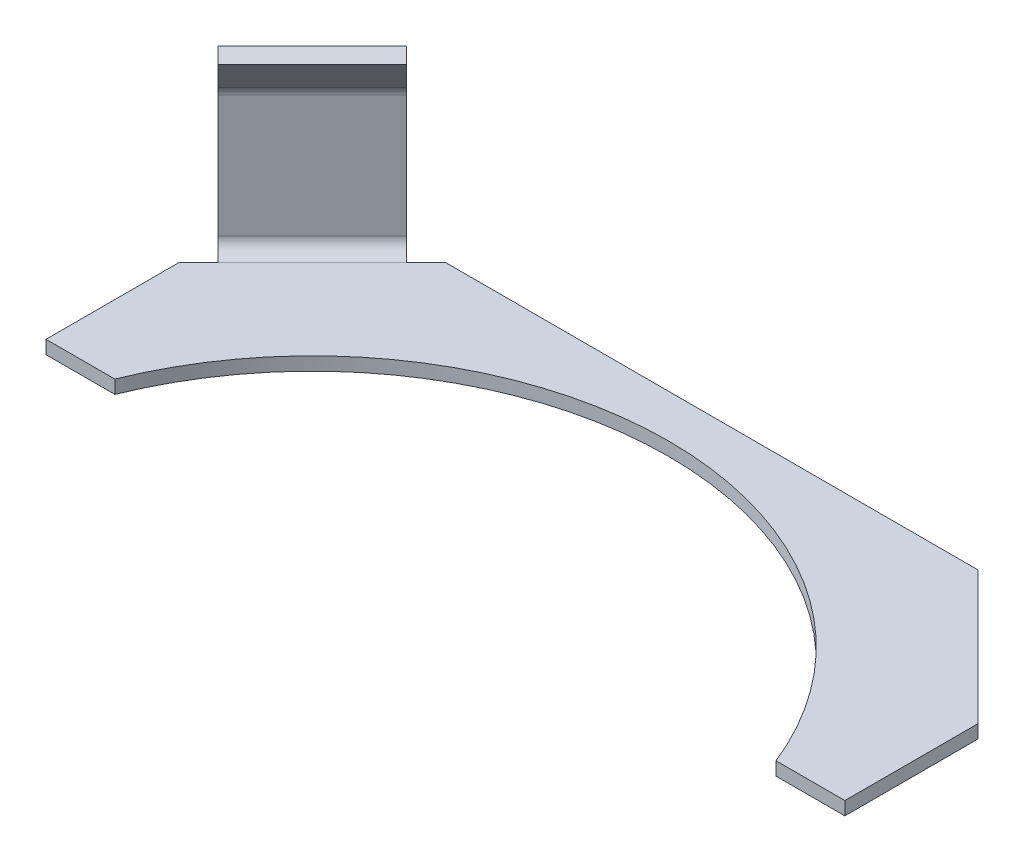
ISO-10303-21;
HEADER;
FILE_DESCRIPTION(('STEP AP214'),'2;1');
FILE_NAME('part.step','',(''),(''),'','','');
FILE_SCHEMA(('AUTOMOTIVE_DESIGN { 1 0 10303 214 1 1 1 1 }'));
ENDSEC;
DATA;
#1=APPLICATION_CONTEXT('core data for automotive mechanical design processes');
#2=APPLICATION_PROTOCOL_DEFINITION('international standard','automotive_design',2000,#1);
#3=PRODUCT_CONTEXT('',#1,'mechanical');
#4=PRODUCT('Part','Part','',(#3));
#5=PRODUCT_RELATED_PRODUCT_CATEGORY('part','',(#4));
#6=PRODUCT_DEFINITION_FORMATION('','',#4);
#7=PRODUCT_DEFINITION_CONTEXT('part definition',#1,'design');
#8=PRODUCT_DEFINITION('design','',#6,#7);
#9=PRODUCT_DEFINITION_SHAPE('','',#8);
#10=(LENGTH_UNIT() NAMED_UNIT(*) SI_UNIT(.MILLI.,.METRE.));
#11=(NAMED_UNIT(*) PLANE_ANGLE_UNIT() SI_UNIT($,.RADIAN.));
#12=(NAMED_UNIT(*) SI_UNIT($,.STERADIAN.) SOLID_ANGLE_UNIT());
#13=UNCERTAINTY_MEASURE_WITH_UNIT(LENGTH_MEASURE(1.E-05),#10,'distance_accuracy_value','');
#14=(GEOMETRIC_REPRESENTATION_CONTEXT(3) GLOBAL_UNCERTAINTY_ASSIGNED_CONTEXT((#13)) GLOBAL_UNIT_ASSIGNED_CONTEXT((#10,
#11,#12)) REPRESENTATION_CONTEXT('',''));
#15=CARTESIAN_POINT('',(0.,0.,0.));
#16=DIRECTION('',(0.,0.,1.));
#17=DIRECTION('',(1.,0.,0.));
#18=AXIS2_PLACEMENT_3D('',#15,#16,#17);
#19=CARTESIAN_POINT('',(-0.120425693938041,-0.733452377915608,-0.828102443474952));
#20=DIRECTION('',(-0.499999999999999,-0.707106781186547,-0.500000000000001));
#21=DIRECTION('',(0.707106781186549,0.,-0.707106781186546));
#22=AXIS2_PLACEMENT_3D('',#19,#20,#21);
#23=PLANE('',#22);
#24=DIRECTION('',(-0.499999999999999,0.707106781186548,-0.500000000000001));
#25=VECTOR('',#24,1.);
#26=CARTESIAN_POINT('',(-0.120425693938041,-0.733452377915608,-0.828102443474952));
#27=LINE('',#26,#25);
#28=CARTESIAN_POINT('',(-1.83758298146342,1.69497474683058,-2.54525973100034));
#29=VERTEX_POINT('',#28);
#30=CARTESIAN_POINT('',(-1.88758298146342,1.76568542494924,-2.59525973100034));
#31=VERTEX_POINT('',#30);
#32=EDGE_CURVE('E203',#29,#31,#27,.T.);
#33=ORIENTED_EDGE('',*,*,#32,.T.);
#34=DIRECTION('',(-0.707106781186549,0.,0.707106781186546));
#35=VECTOR('',#34,1.);
#36=CARTESIAN_POINT('',(-1.88758298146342,1.76568542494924,-2.59525973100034));
#37=LINE('',#36,#35);
#38=CARTESIAN_POINT('',(-2.59468976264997,1.76568542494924,-1.88815294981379));
#39=VERTEX_POINT('',#38);
#40=EDGE_CURVE('E194',#31,#39,#37,.T.);
#41=ORIENTED_EDGE('',*,*,#40,.T.);
#42=DIRECTION('',(-0.499999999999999,0.707106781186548,-0.500000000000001));
#43=VECTOR('',#42,1.);
#44=CARTESIAN_POINT('',(-0.82753247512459,-0.733452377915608,-0.120995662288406));
#45=LINE('',#44,#43);
#46=CARTESIAN_POINT('',(-2.54468976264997,1.69497474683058,-1.83815294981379));
#47=VERTEX_POINT('',#46);
#48=EDGE_CURVE('E223',#47,#39,#45,.T.);
#49=ORIENTED_EDGE('',*,*,#48,.F.);
#50=DIRECTION('',(-0.707106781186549,0.,0.707106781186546));
#51=VECTOR('',#50,1.);
#52=CARTESIAN_POINT('',(-1.83758298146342,1.69497474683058,-2.54525973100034));
#53=LINE('',#52,#51);
#54=EDGE_CURVE('E11',#29,#47,#53,.T.);
#55=ORIENTED_EDGE('',*,*,#54,.F.);
#56=EDGE_LOOP('',(#33,#41,#49,#55));
#57=FACE_BOUND('',#56,.T.);
#58=ADVANCED_FACE('F38',(#57),#23,.F.);
#59=CARTESIAN_POINT('',(-0.52042569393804,-1.29913780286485,-1.22810244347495));
#60=DIRECTION('',(-0.707106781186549,0.,0.707106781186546));
#61=DIRECTION('',(-0.499999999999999,-0.707106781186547,-0.500000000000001));
#62=AXIS2_PLACEMENT_3D('',#59,#60,#61);
#63=PLANE('',#62);
#64=DIRECTION('',(-0.499999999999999,0.707106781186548,-0.500000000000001));
#65=VECTOR('',#64,1.);
#66=CARTESIAN_POINT('',(-0.47900433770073,-1.24055915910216,-1.18668108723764));
#67=LINE('',#66,#65);
#68=CARTESIAN_POINT('',(-2.19616162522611,1.18786796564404,-2.90383837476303));
#69=VERTEX_POINT('',#68);
#70=CARTESIAN_POINT('',(-2.24616162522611,1.25857864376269,-2.95383837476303));
#71=VERTEX_POINT('',#70);
#72=EDGE_CURVE('E186',#69,#71,#67,.T.);
#73=ORIENTED_EDGE('',*,*,#72,.T.);
#74=DIRECTION('',(0.499999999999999,0.707106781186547,0.500000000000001));
#75=VECTOR('',#74,1.);
#76=CARTESIAN_POINT('',(-2.28758298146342,1.2,-2.99525973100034));
#77=LINE('',#76,#75);
#78=EDGE_CURVE('E70',#71,#31,#77,.T.);
#79=ORIENTED_EDGE('',*,*,#78,.T.);
#80=ORIENTED_EDGE('',*,*,#32,.F.);
#81=DIRECTION('',(0.499999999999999,0.707106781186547,0.500000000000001));
#82=VECTOR('',#81,1.);
#83=CARTESIAN_POINT('',(-2.23758298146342,1.12928932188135,-2.94525973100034));
#84=LINE('',#83,#82);
#85=EDGE_CURVE('E48',#69,#29,#84,.T.);
#86=ORIENTED_EDGE('',*,*,#85,.F.);
#87=EDGE_LOOP('',(#73,#79,#80,#86));
#88=FACE_BOUND('',#87,.T.);
#89=ADVANCED_FACE('F193',(#88),#63,.F.);
#90=CARTESIAN_POINT('',(-2.28758298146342,1.2,-2.99525973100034));
#91=DIRECTION('',(0.499999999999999,-0.707106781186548,0.500000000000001));
#92=DIRECTION('',(0.,-0.577350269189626,-0.816496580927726));
#93=AXIS2_PLACEMENT_3D('',#90,#91,#92);
#94=PLANE('',#93);
#95=ORIENTED_EDGE('',*,*,#78,.F.);
#96=DIRECTION('',(-0.707106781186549,0.,0.707106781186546));
#97=VECTOR('',#96,1.);
#98=CARTESIAN_POINT('',(-2.24616162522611,1.25857864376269,-2.95383837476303));
#99=LINE('',#98,#97);
#100=CARTESIAN_POINT('',(-2.95326840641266,1.25857864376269,-2.24673159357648));
#101=VERTEX_POINT('',#100);
#102=EDGE_CURVE('E175',#71,#101,#99,.T.);
#103=ORIENTED_EDGE('',*,*,#102,.T.);
#104=DIRECTION('',(0.499999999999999,0.707106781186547,0.500000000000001));
#105=VECTOR('',#104,1.);
#106=CARTESIAN_POINT('',(-2.99468976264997,1.2,-2.28815294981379));
#107=LINE('',#106,#105);
#108=EDGE_CURVE('E182',#101,#39,#107,.T.);
#109=ORIENTED_EDGE('',*,*,#108,.T.);
#110=ORIENTED_EDGE('',*,*,#40,.F.);
#111=EDGE_LOOP('',(#95,#103,#109,#110));
#112=FACE_BOUND('',#111,.T.);
#113=ADVANCED_FACE('F197',(#112),#94,.F.);
#114=CARTESIAN_POINT('',(-1.22753247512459,-1.29913780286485,-0.520995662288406));
#115=DIRECTION('',(-0.707106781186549,0.,0.707106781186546));
#116=DIRECTION('',(-0.499999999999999,-0.707106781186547,-0.500000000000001));
#117=AXIS2_PLACEMENT_3D('',#114,#115,#116);
#118=PLANE('',#117);
#119=ORIENTED_EDGE('',*,*,#108,.F.);
#120=DIRECTION('',(-0.499999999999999,0.707106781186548,-0.500000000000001));
#121=VECTOR('',#120,1.);
#122=CARTESIAN_POINT('',(-1.18611111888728,-1.24055915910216,-0.479574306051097));
#123=LINE('',#122,#121);
#124=CARTESIAN_POINT('',(-2.90326840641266,1.18786796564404,-2.19673159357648));
#125=VERTEX_POINT('',#124);
#126=EDGE_CURVE('E204',#125,#101,#123,.T.);
#127=ORIENTED_EDGE('',*,*,#126,.F.);
#128=DIRECTION('',(0.499999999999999,0.707106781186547,0.500000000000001));
#129=VECTOR('',#128,1.);
#130=CARTESIAN_POINT('',(-2.94468976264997,1.12928932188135,-2.23815294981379));
#131=LINE('',#130,#129);
#132=EDGE_CURVE('E225',#125,#47,#131,.T.);
#133=ORIENTED_EDGE('',*,*,#132,.T.);
#134=ORIENTED_EDGE('',*,*,#48,.T.);
#135=EDGE_LOOP('',(#119,#127,#133,#134));
#136=FACE_BOUND('',#135,.T.);
#137=ADVANCED_FACE('F227',(#136),#118,.T.);
#138=CARTESIAN_POINT('',(-2.23758298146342,1.12928932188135,-2.94525973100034));
#139=DIRECTION('',(0.499999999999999,-0.707106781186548,0.500000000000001));
#140=DIRECTION('',(0.,-0.577350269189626,-0.816496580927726));
#141=AXIS2_PLACEMENT_3D('',#138,#139,#140);
#142=PLANE('',#141);
#143=DIRECTION('',(-0.707106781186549,0.,0.707106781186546));
#144=VECTOR('',#143,1.);
#145=CARTESIAN_POINT('',(-2.19616162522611,1.18786796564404,-2.90383837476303));
#146=LINE('',#145,#144);
#147=EDGE_CURVE('E42',#69,#125,#146,.T.);
#148=ORIENTED_EDGE('',*,*,#147,.F.);
#149=ORIENTED_EDGE('',*,*,#85,.T.);
#150=ORIENTED_EDGE('',*,*,#54,.T.);
#151=ORIENTED_EDGE('',*,*,#132,.F.);
#152=EDGE_LOOP('',(#148,#149,#150,#151));
#153=FACE_BOUND('',#152,.T.);
#154=ADVANCED_FACE('F40',(#153),#142,.T.);
#155=CARTESIAN_POINT('',(0.494397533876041,0.1,-0.213279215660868));
#156=DIRECTION('',(-0.707106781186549,0.,0.707106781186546));
#157=DIRECTION('',(0.,-1.,0.));
#158=AXIS2_PLACEMENT_3D('',#155,#156,#157);
#159=PLANE('',#158);
#160=DIRECTION('',(-0.707106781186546,0.,-0.707106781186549));
#161=VECTOR('',#160,1.);
#162=CARTESIAN_POINT('',(0.494397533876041,0.2,-0.213279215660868));
#163=LINE('',#162,#161);
#164=CARTESIAN_POINT('',(-2.21687230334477,0.2,-2.92454905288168));
#165=VERTEX_POINT('',#164);
#166=CARTESIAN_POINT('',(-2.28758298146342,0.2,-2.99525973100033));
#167=VERTEX_POINT('',#166);
#168=EDGE_CURVE('E257',#165,#167,#163,.T.);
#169=ORIENTED_EDGE('',*,*,#168,.T.);
#170=DIRECTION('',(0.,-1.,0.));
#171=VECTOR('',#170,1.);
#172=CARTESIAN_POINT('',(-2.2875829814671,0.1,-2.99525973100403));
#173=LINE('',#172,#171);
#174=CARTESIAN_POINT('',(-2.28758298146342,1.11715728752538,-2.99525973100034));
#175=VERTEX_POINT('',#174);
#176=EDGE_CURVE('E258',#175,#167,#173,.T.);
#177=ORIENTED_EDGE('',*,*,#176,.F.);
#178=DIRECTION('',(-0.707106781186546,0.,-0.707106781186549));
#179=VECTOR('',#178,1.);
#180=CARTESIAN_POINT('',(0.494397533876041,1.11715728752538,-0.213279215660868));
#181=LINE('',#180,#179);
#182=CARTESIAN_POINT('',(-2.21687230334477,1.11715728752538,-2.92454905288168));
#183=VERTEX_POINT('',#182);
#184=EDGE_CURVE('E189',#183,#175,#181,.T.);
#185=ORIENTED_EDGE('',*,*,#184,.F.);
#186=DIRECTION('',(0.,1.,0.));
#187=VECTOR('',#186,1.);
#188=CARTESIAN_POINT('',(-2.21687230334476,0.1,-2.92454905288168));
#189=LINE('',#188,#187);
#190=EDGE_CURVE('E260',#165,#183,#189,.T.);
#191=ORIENTED_EDGE('',*,*,#190,.F.);
#192=EDGE_LOOP('',(#169,#177,#185,#191));
#193=FACE_BOUND('',#192,.T.);
#194=ADVANCED_FACE('F237',(#193),#159,.F.);
#195=CARTESIAN_POINT('',(-0.212709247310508,0.1,0.493827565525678));
#196=DIRECTION('',(-0.707106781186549,0.,0.707106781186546));
#197=DIRECTION('',(0.,-1.,0.));
#198=AXIS2_PLACEMENT_3D('',#195,#196,#197);
#199=PLANE('',#198);
#200=DIRECTION('',(0.,-1.,0.));
#201=VECTOR('',#200,1.);
#202=CARTESIAN_POINT('',(-2.9946897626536,0.1,-2.28815294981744));
#203=LINE('',#202,#201);
#204=CARTESIAN_POINT('',(-2.99468976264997,1.11715728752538,-2.28815294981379));
#205=VERTEX_POINT('',#204);
#206=CARTESIAN_POINT('',(-2.9946897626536,0.200000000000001,-2.28815294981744));
#207=VERTEX_POINT('',#206);
#208=EDGE_CURVE('E268',#205,#207,#203,.T.);
#209=ORIENTED_EDGE('',*,*,#208,.T.);
#210=DIRECTION('',(-0.707106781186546,0.,-0.707106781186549));
#211=VECTOR('',#210,1.);
#212=CARTESIAN_POINT('',(-0.212709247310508,0.200000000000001,0.493827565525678));
#213=LINE('',#212,#211);
#214=CARTESIAN_POINT('',(-2.92397908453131,0.2,-2.21744227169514));
#215=VERTEX_POINT('',#214);
#216=EDGE_CURVE('E264',#215,#207,#213,.T.);
#217=ORIENTED_EDGE('',*,*,#216,.F.);
#218=DIRECTION('',(0.,1.,0.));
#219=VECTOR('',#218,1.);
#220=CARTESIAN_POINT('',(-2.92397908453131,0.1,-2.21744227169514));
#221=LINE('',#220,#219);
#222=CARTESIAN_POINT('',(-2.92397908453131,1.11715728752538,-2.21744227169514));
#223=VERTEX_POINT('',#222);
#224=EDGE_CURVE('E270',#215,#223,#221,.T.);
#225=ORIENTED_EDGE('',*,*,#224,.T.);
#226=DIRECTION('',(-0.707106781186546,0.,-0.707106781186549));
#227=VECTOR('',#226,1.);
#228=CARTESIAN_POINT('',(-0.212709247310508,1.11715728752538,0.493827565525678));
#229=LINE('',#228,#227);
#230=EDGE_CURVE('E283',#223,#205,#229,.T.);
#231=ORIENTED_EDGE('',*,*,#230,.T.);
#232=EDGE_LOOP('',(#209,#217,#225,#231));
#233=FACE_BOUND('',#232,.T.);
#234=ADVANCED_FACE('F248',(#233),#199,.T.);
#235=CARTESIAN_POINT('',(-2.21687230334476,0.1,-2.92454905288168));
#236=DIRECTION('',(0.707106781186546,0.,0.707106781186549));
#237=DIRECTION('',(0.707106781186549,0.,-0.707106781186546));
#238=AXIS2_PLACEMENT_3D('',#235,#236,#237);
#239=PLANE('',#238);
#240=ORIENTED_EDGE('',*,*,#190,.T.);
#241=DIRECTION('',(-0.707106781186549,0.,0.707106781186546));
#242=VECTOR('',#241,1.);
#243=CARTESIAN_POINT('',(-2.21687230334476,1.11715728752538,-2.92454905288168));
#244=LINE('',#243,#242);
#245=EDGE_CURVE('E265',#183,#223,#244,.T.);
#246=ORIENTED_EDGE('',*,*,#245,.T.);
#247=ORIENTED_EDGE('',*,*,#224,.F.);
#248=DIRECTION('',(-0.707106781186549,0.,0.707106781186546));
#249=VECTOR('',#248,1.);
#250=CARTESIAN_POINT('',(-2.21687230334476,0.2,-2.92454905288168));
#251=LINE('',#250,#249);
#252=EDGE_CURVE('E214',#165,#215,#251,.T.);
#253=ORIENTED_EDGE('',*,*,#252,.F.);
#254=EDGE_LOOP('',(#240,#246,#247,#253));
#255=FACE_BOUND('',#254,.T.);
#256=ADVANCED_FACE('F253',(#255),#239,.T.);
#257=CARTESIAN_POINT('',(-2.9946897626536,0.1,-2.28815294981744));
#258=DIRECTION('',(0.707106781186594,0.,0.707106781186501));
#259=DIRECTION('',(0.707106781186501,0.,-0.707106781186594));
#260=AXIS2_PLACEMENT_3D('',#257,#258,#259);
#261=PLANE('',#260);
#262=DIRECTION('',(-0.707106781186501,0.,0.707106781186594));
#263=VECTOR('',#262,1.);
#264=CARTESIAN_POINT('',(-2.28758298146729,1.11715728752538,-2.99525973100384));
#265=LINE('',#264,#263);
#266=EDGE_CURVE('E90',#175,#205,#265,.T.);
#267=ORIENTED_EDGE('',*,*,#266,.F.);
#268=ORIENTED_EDGE('',*,*,#176,.T.);
#269=DIRECTION('',(-0.707106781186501,0.,0.707106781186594));
#270=VECTOR('',#269,1.);
#271=CARTESIAN_POINT('',(-2.28758298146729,0.200000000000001,-2.99525973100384));
#272=LINE('',#271,#270);
#273=EDGE_CURVE('E209',#167,#207,#272,.T.);
#274=ORIENTED_EDGE('',*,*,#273,.T.);
#275=ORIENTED_EDGE('',*,*,#208,.F.);
#276=EDGE_LOOP('',(#267,#268,#274,#275));
#277=FACE_BOUND('',#276,.T.);
#278=ADVANCED_FACE('F267',(#277),#261,.F.);
#279=CARTESIAN_POINT('',(2.00000000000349,12.7491106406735,-3.));
#280=DIRECTION('',(0.,0.,1.));
#281=DIRECTION('',(1.,0.,0.));
#282=AXIS2_PLACEMENT_3D('',#279,#280,#281);
#283=PLANE('',#282);
#284=DIRECTION('',(0.,-1.,0.));
#285=VECTOR('',#284,1.);
#286=CARTESIAN_POINT('',(2.00000000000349,12.7491106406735,-3.));
#287=LINE('',#286,#285);
#288=CARTESIAN_POINT('',(2.00000000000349,0.100000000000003,-3.));
#289=VERTEX_POINT('',#288);
#290=CARTESIAN_POINT('',(2.00000000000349,0.,-3.));
#291=VERTEX_POINT('',#290);
#292=EDGE_CURVE('E391',#289,#291,#287,.T.);
#293=ORIENTED_EDGE('',*,*,#292,.T.);
#294=DIRECTION('',(-1.,0.,0.));
#295=VECTOR('',#294,1.);
#296=CARTESIAN_POINT('',(2.00000000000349,0.,-3.));
#297=LINE('',#296,#295);
#298=CARTESIAN_POINT('',(-1.99999999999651,0.,-3.));
#299=VERTEX_POINT('',#298);
#300=EDGE_CURVE('E388',#291,#299,#297,.T.);
#301=ORIENTED_EDGE('',*,*,#300,.T.);
#302=DIRECTION('',(0.,-1.,0.));
#303=VECTOR('',#302,1.);
#304=CARTESIAN_POINT('',(-1.99999999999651,12.7491106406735,-3.));
#305=LINE('',#304,#303);
#306=CARTESIAN_POINT('',(-1.99999999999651,0.1,-3.));
#307=VERTEX_POINT('',#306);
#308=EDGE_CURVE('E315',#307,#299,#305,.T.);
#309=ORIENTED_EDGE('',*,*,#308,.F.);
#310=DIRECTION('',(-1.,0.,0.));
#311=VECTOR('',#310,1.);
#312=CARTESIAN_POINT('',(2.00000000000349,0.1,-3.));
#313=LINE('',#312,#311);
#314=EDGE_CURVE('E322',#289,#307,#313,.T.);
#315=ORIENTED_EDGE('',*,*,#314,.F.);
#316=EDGE_LOOP('',(#293,#301,#309,#315));
#317=FACE_BOUND('',#316,.T.);
#318=ADVANCED_FACE('F409',(#317),#283,.F.);
#319=CARTESIAN_POINT('',(3.00000000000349,12.7491106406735,-2.));
#320=DIRECTION('',(-0.707106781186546,0.,0.707106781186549));
#321=DIRECTION('',(0.707106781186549,0.,0.707106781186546));
#322=AXIS2_PLACEMENT_3D('',#319,#320,#321);
#323=PLANE('',#322);
#324=DIRECTION('',(0.,-1.,0.));
#325=VECTOR('',#324,1.);
#326=CARTESIAN_POINT('',(3.00000000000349,12.7491106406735,-2.));
#327=LINE('',#326,#325);
#328=CARTESIAN_POINT('',(3.00000000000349,0.100000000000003,-2.));
#329=VERTEX_POINT('',#328);
#330=CARTESIAN_POINT('',(3.00000000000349,0.,-2.));
#331=VERTEX_POINT('',#330);
#332=EDGE_CURVE('E385',#329,#331,#327,.T.);
#333=ORIENTED_EDGE('',*,*,#332,.T.);
#334=DIRECTION('',(-0.707106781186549,0.,-0.707106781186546));
#335=VECTOR('',#334,1.);
#336=CARTESIAN_POINT('',(3.00000000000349,0.,-2.));
#337=LINE('',#336,#335);
#338=EDGE_CURVE('E382',#331,#291,#337,.T.);
#339=ORIENTED_EDGE('',*,*,#338,.T.);
#340=ORIENTED_EDGE('',*,*,#292,.F.);
#341=DIRECTION('',(-0.707106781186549,0.,-0.707106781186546));
#342=VECTOR('',#341,1.);
#343=CARTESIAN_POINT('',(3.00000000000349,0.1,-2.));
#344=LINE('',#343,#342);
#345=EDGE_CURVE('E325',#329,#289,#344,.T.);
#346=ORIENTED_EDGE('',*,*,#345,.F.);
#347=EDGE_LOOP('',(#333,#339,#340,#346));
#348=FACE_BOUND('',#347,.T.);
#349=ADVANCED_FACE('F412',(#348),#323,.F.);
#350=CARTESIAN_POINT('',(3.00000000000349,12.7491106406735,-1.));
#351=DIRECTION('',(-1.,0.,0.));
#352=DIRECTION('',(0.,0.,1.));
#353=AXIS2_PLACEMENT_3D('',#350,#351,#352);
#354=PLANE('',#353);
#355=DIRECTION('',(0.,-1.,0.));
#356=VECTOR('',#355,1.);
#357=CARTESIAN_POINT('',(3.00000000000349,12.7491106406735,-1.));
#358=LINE('',#357,#356);
#359=CARTESIAN_POINT('',(3.00000000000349,0.100000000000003,-1.));
#360=VERTEX_POINT('',#359);
#361=CARTESIAN_POINT('',(3.00000000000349,0.,-1.));
#362=VERTEX_POINT('',#361);
#363=EDGE_CURVE('E379',#360,#362,#358,.T.);
#364=ORIENTED_EDGE('',*,*,#363,.T.);
#365=DIRECTION('',(0.,0.,-1.));
#366=VECTOR('',#365,1.);
#367=CARTESIAN_POINT('',(3.00000000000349,0.,-1.));
#368=LINE('',#367,#366);
#369=EDGE_CURVE('E376',#362,#331,#368,.T.);
#370=ORIENTED_EDGE('',*,*,#369,.T.);
#371=ORIENTED_EDGE('',*,*,#332,.F.);
#372=DIRECTION('',(0.,0.,-1.));
#373=VECTOR('',#372,1.);
#374=CARTESIAN_POINT('',(3.00000000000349,0.1,-1.));
#375=LINE('',#374,#373);
#376=EDGE_CURVE('E328',#360,#329,#375,.T.);
#377=ORIENTED_EDGE('',*,*,#376,.F.);
#378=EDGE_LOOP('',(#364,#370,#371,#377));
#379=FACE_BOUND('',#378,.T.);
#380=ADVANCED_FACE('F415',(#379),#354,.F.);
#381=CARTESIAN_POINT('',(2.48286636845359,12.7491106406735,-1.00000000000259));
#382=DIRECTION('',(5.0137158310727E-12,0.,-1.));
#383=DIRECTION('',(-1.,0.,-5.0137158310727E-12));
#384=AXIS2_PLACEMENT_3D('',#381,#382,#383);
#385=PLANE('',#384);
#386=DIRECTION('',(0.,-1.,0.));
#387=VECTOR('',#386,1.);
#388=CARTESIAN_POINT('',(2.48286636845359,12.7491106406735,-1.00000000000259));
#389=LINE('',#388,#387);
#390=CARTESIAN_POINT('',(2.48286636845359,0.100000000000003,-1.00000000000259));
#391=VERTEX_POINT('',#390);
#392=CARTESIAN_POINT('',(2.48286636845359,0.,-1.00000000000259));
#393=VERTEX_POINT('',#392);
#394=EDGE_CURVE('E373',#391,#393,#389,.T.);
#395=ORIENTED_EDGE('',*,*,#394,.T.);
#396=DIRECTION('',(1.,0.,5.0137158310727E-12));
#397=VECTOR('',#396,1.);
#398=CARTESIAN_POINT('',(2.48286636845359,0.,-1.00000000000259));
#399=LINE('',#398,#397);
#400=EDGE_CURVE('E370',#393,#362,#399,.T.);
#401=ORIENTED_EDGE('',*,*,#400,.T.);
#402=ORIENTED_EDGE('',*,*,#363,.F.);
#403=DIRECTION('',(1.,0.,5.0137158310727E-12));
#404=VECTOR('',#403,1.);
#405=CARTESIAN_POINT('',(2.48286636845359,0.1,-1.00000000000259));
#406=LINE('',#405,#404);
#407=EDGE_CURVE('E331',#391,#360,#406,.T.);
#408=ORIENTED_EDGE('',*,*,#407,.F.);
#409=EDGE_LOOP('',(#395,#401,#402,#408));
#410=FACE_BOUND('',#409,.T.);
#411=ADVANCED_FACE('F421',(#410),#385,.F.);
#412=CARTESIAN_POINT('',(0.,12.7491106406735,0.));
#413=DIRECTION('',(0.,-1.,0.));
#414=DIRECTION('',(0.,0.,-1.));
#415=AXIS2_PLACEMENT_3D('',#412,#413,#414);
#416=CYLINDRICAL_SURFACE('',#415,2.67668178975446);
#417=DIRECTION('',(0.,-1.,0.));
#418=VECTOR('',#417,1.);
#419=CARTESIAN_POINT('',(-2.48286636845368,12.7491106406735,-1.00000000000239));
#420=LINE('',#419,#418);
#421=CARTESIAN_POINT('',(-2.48286636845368,0.100000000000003,-1.00000000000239));
#422=VERTEX_POINT('',#421);
#423=CARTESIAN_POINT('',(-2.48286636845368,0.,-1.00000000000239));
#424=VERTEX_POINT('',#423);
#425=EDGE_CURVE('E367',#422,#424,#420,.T.);
#426=ORIENTED_EDGE('',*,*,#425,.T.);
#427=CARTESIAN_POINT('',(0.,0.,0.));
#428=DIRECTION('',(0.,-1.,0.));
#429=DIRECTION('',(0.,0.,1.));
#430=AXIS2_PLACEMENT_3D('',#427,#428,#429);
#431=CIRCLE('',#430,2.67668178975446);
#432=EDGE_CURVE('E364',#424,#393,#431,.T.);
#433=ORIENTED_EDGE('',*,*,#432,.T.);
#434=ORIENTED_EDGE('',*,*,#394,.F.);
#435=CARTESIAN_POINT('',(0.,0.1,0.));
#436=DIRECTION('',(0.,-1.,0.));
#437=DIRECTION('',(0.,0.,1.));
#438=AXIS2_PLACEMENT_3D('',#435,#436,#437);
#439=CIRCLE('',#438,2.67668178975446);
#440=EDGE_CURVE('E334',#422,#391,#439,.T.);
#441=ORIENTED_EDGE('',*,*,#440,.F.);
#442=EDGE_LOOP('',(#426,#433,#434,#441));
#443=FACE_BOUND('',#442,.T.);
#444=ADVANCED_FACE('F423',(#443),#416,.F.);
#445=CARTESIAN_POINT('',(-2.99999999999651,12.7491106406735,-1.));
#446=DIRECTION('',(-4.61704650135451E-12,0.,-1.));
#447=DIRECTION('',(-1.,0.,4.61704650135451E-12));
#448=AXIS2_PLACEMENT_3D('',#445,#446,#447);
#449=PLANE('',#448);
#450=DIRECTION('',(0.,-1.,0.));
#451=VECTOR('',#450,1.);
#452=CARTESIAN_POINT('',(-2.99999999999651,12.7491106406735,-1.));
#453=LINE('',#452,#451);
#454=CARTESIAN_POINT('',(-2.99999999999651,0.100000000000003,-1.));
#455=VERTEX_POINT('',#454);
#456=CARTESIAN_POINT('',(-2.99999999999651,0.,-1.));
#457=VERTEX_POINT('',#456);
#458=EDGE_CURVE('E361',#455,#457,#453,.T.);
#459=ORIENTED_EDGE('',*,*,#458,.T.);
#460=DIRECTION('',(1.,0.,-4.61704650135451E-12));
#461=VECTOR('',#460,1.);
#462=CARTESIAN_POINT('',(-2.99999999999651,0.,-1.));
#463=LINE('',#462,#461);
#464=EDGE_CURVE('E358',#457,#424,#463,.T.);
#465=ORIENTED_EDGE('',*,*,#464,.T.);
#466=ORIENTED_EDGE('',*,*,#425,.F.);
#467=DIRECTION('',(1.,0.,-4.61704650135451E-12));
#468=VECTOR('',#467,1.);
#469=CARTESIAN_POINT('',(-2.99999999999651,0.1,-1.));
#470=LINE('',#469,#468);
#471=EDGE_CURVE('E337',#455,#422,#470,.T.);
#472=ORIENTED_EDGE('',*,*,#471,.F.);
#473=EDGE_LOOP('',(#459,#465,#466,#472));
#474=FACE_BOUND('',#473,.T.);
#475=ADVANCED_FACE('F426',(#474),#449,.F.);
#476=CARTESIAN_POINT('',(-2.99999999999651,12.7491106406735,-2.00000000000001));
#477=DIRECTION('',(1.,0.,0.));
#478=DIRECTION('',(0.,0.,-1.));
#479=AXIS2_PLACEMENT_3D('',#476,#477,#478);
#480=PLANE('',#479);
#481=DIRECTION('',(0.,-1.,0.));
#482=VECTOR('',#481,1.);
#483=CARTESIAN_POINT('',(-2.99999999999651,12.7491106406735,-2.00000000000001));
#484=LINE('',#483,#482);
#485=CARTESIAN_POINT('',(-2.99999999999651,0.100000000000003,-2.00000000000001));
#486=VERTEX_POINT('',#485);
#487=CARTESIAN_POINT('',(-2.99999999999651,0.,-2.00000000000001));
#488=VERTEX_POINT('',#487);
#489=EDGE_CURVE('E355',#486,#488,#484,.T.);
#490=ORIENTED_EDGE('',*,*,#489,.T.);
#491=DIRECTION('',(0.,0.,1.));
#492=VECTOR('',#491,1.);
#493=CARTESIAN_POINT('',(-2.99999999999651,0.,-2.00000000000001));
#494=LINE('',#493,#492);
#495=EDGE_CURVE('E352',#488,#457,#494,.T.);
#496=ORIENTED_EDGE('',*,*,#495,.T.);
#497=ORIENTED_EDGE('',*,*,#458,.F.);
#498=DIRECTION('',(0.,0.,1.));
#499=VECTOR('',#498,1.);
#500=CARTESIAN_POINT('',(-2.99999999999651,0.1,-2.00000000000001));
#501=LINE('',#500,#499);
#502=EDGE_CURVE('E340',#486,#455,#501,.T.);
#503=ORIENTED_EDGE('',*,*,#502,.F.);
#504=EDGE_LOOP('',(#490,#496,#497,#503));
#505=FACE_BOUND('',#504,.T.);
#506=ADVANCED_FACE('F429',(#505),#480,.F.);
#507=CARTESIAN_POINT('',(0.,0.1,0.));
#508=DIRECTION('',(0.,1.,0.));
#509=DIRECTION('',(0.,0.,1.));
#510=AXIS2_PLACEMENT_3D('',#507,#508,#509);
#511=PLANE('',#510);
#512=DIRECTION('',(-0.707106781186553,0.,0.707106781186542));
#513=VECTOR('',#512,1.);
#514=CARTESIAN_POINT('',(-1.99999999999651,0.1,-3.));
#515=LINE('',#514,#513);
#516=CARTESIAN_POINT('',(-2.14616162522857,0.0999999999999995,-2.85383837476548));
#517=VERTEX_POINT('',#516);
#518=EDGE_CURVE('E349',#307,#517,#515,.T.);
#519=ORIENTED_EDGE('',*,*,#518,.T.);
#520=DIRECTION('',(-0.707106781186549,0.,0.707106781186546));
#521=VECTOR('',#520,1.);
#522=CARTESIAN_POINT('',(-2.1461616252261,0.0999999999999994,-2.85383837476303));
#523=LINE('',#522,#521);
#524=CARTESIAN_POINT('',(-2.85326840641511,0.0999999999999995,-2.14673159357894));
#525=VERTEX_POINT('',#524);
#526=EDGE_CURVE('E346',#517,#525,#523,.T.);
#527=ORIENTED_EDGE('',*,*,#526,.T.);
#528=DIRECTION('',(-0.70710678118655,0.,0.707106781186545));
#529=VECTOR('',#528,1.);
#530=CARTESIAN_POINT('',(-2.85326840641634,0.1,-2.14673159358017));
#531=LINE('',#530,#529);
#532=EDGE_CURVE('E343',#525,#486,#531,.T.);
#533=ORIENTED_EDGE('',*,*,#532,.T.);
#534=ORIENTED_EDGE('',*,*,#502,.T.);
#535=ORIENTED_EDGE('',*,*,#471,.T.);
#536=ORIENTED_EDGE('',*,*,#440,.T.);
#537=ORIENTED_EDGE('',*,*,#407,.T.);
#538=ORIENTED_EDGE('',*,*,#376,.T.);
#539=ORIENTED_EDGE('',*,*,#345,.T.);
#540=ORIENTED_EDGE('',*,*,#314,.T.);
#541=EDGE_LOOP('',(#519,#527,#533,#534,#535,#536,#537,#538,#539,#540));
#542=FACE_BOUND('',#541,.T.);
#543=ADVANCED_FACE('F418',(#542),#511,.T.);
#544=CARTESIAN_POINT('',(-2.85326840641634,12.7491106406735,-2.14673159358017));
#545=DIRECTION('',(0.707106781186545,0.,0.70710678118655));
#546=DIRECTION('',(0.70710678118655,0.,-0.707106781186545));
#547=AXIS2_PLACEMENT_3D('',#544,#545,#546);
#548=PLANE('',#547);
#549=DIRECTION('',(0.,-1.,0.));
#550=VECTOR('',#549,1.);
#551=CARTESIAN_POINT('',(-2.85326840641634,12.7491106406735,-2.14673159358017));
#552=LINE('',#551,#550);
#553=CARTESIAN_POINT('',(-2.85326840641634,0.,-2.14673159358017));
#554=VERTEX_POINT('',#553);
#555=EDGE_CURVE('E305',#525,#554,#552,.T.);
#556=ORIENTED_EDGE('',*,*,#555,.T.);
#557=DIRECTION('',(-0.70710678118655,0.,0.707106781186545));
#558=VECTOR('',#557,1.);
#559=CARTESIAN_POINT('',(-2.85326840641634,0.,-2.14673159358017));
#560=LINE('',#559,#558);
#561=EDGE_CURVE('E318',#554,#488,#560,.T.);
#562=ORIENTED_EDGE('',*,*,#561,.T.);
#563=ORIENTED_EDGE('',*,*,#489,.F.);
#564=ORIENTED_EDGE('',*,*,#532,.F.);
#565=EDGE_LOOP('',(#556,#562,#563,#564));
#566=FACE_BOUND('',#565,.T.);
#567=ADVANCED_FACE('F432',(#566),#548,.F.);
#568=CARTESIAN_POINT('',(0.,0.,0.));
#569=DIRECTION('',(0.,1.,0.));
#570=DIRECTION('',(0.,0.,1.));
#571=AXIS2_PLACEMENT_3D('',#568,#569,#570);
#572=PLANE('',#571);
#573=DIRECTION('',(-0.707106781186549,0.,0.707106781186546));
#574=VECTOR('',#573,1.);
#575=CARTESIAN_POINT('',(-2.1461616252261,0.,-2.85383837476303));
#576=LINE('',#575,#574);
#577=CARTESIAN_POINT('',(-2.14616162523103,0.,-2.85383837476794));
#578=VERTEX_POINT('',#577);
#579=EDGE_CURVE('E394',#578,#554,#576,.T.);
#580=ORIENTED_EDGE('',*,*,#579,.F.);
#581=DIRECTION('',(-0.707106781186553,0.,0.707106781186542));
#582=VECTOR('',#581,1.);
#583=CARTESIAN_POINT('',(-1.99999999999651,0.,-3.));
#584=LINE('',#583,#582);
#585=EDGE_CURVE('E273',#299,#578,#584,.T.);
#586=ORIENTED_EDGE('',*,*,#585,.F.);
#587=ORIENTED_EDGE('',*,*,#300,.F.);
#588=ORIENTED_EDGE('',*,*,#338,.F.);
#589=ORIENTED_EDGE('',*,*,#369,.F.);
#590=ORIENTED_EDGE('',*,*,#400,.F.);
#591=ORIENTED_EDGE('',*,*,#432,.F.);
#592=ORIENTED_EDGE('',*,*,#464,.F.);
#593=ORIENTED_EDGE('',*,*,#495,.F.);
#594=ORIENTED_EDGE('',*,*,#561,.F.);
#595=EDGE_LOOP('',(#580,#586,#587,#588,#589,#590,#591,#592,#593,#594));
#596=FACE_BOUND('',#595,.T.);
#597=ADVANCED_FACE('F406',(#596),#572,.F.);
#598=CARTESIAN_POINT('',(-1.99999999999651,12.7491106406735,-3.));
#599=DIRECTION('',(0.707106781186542,0.,0.707106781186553));
#600=DIRECTION('',(0.707106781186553,0.,-0.707106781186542));
#601=AXIS2_PLACEMENT_3D('',#598,#599,#600);
#602=PLANE('',#601);
#603=ORIENTED_EDGE('',*,*,#308,.T.);
#604=ORIENTED_EDGE('',*,*,#585,.T.);
#605=DIRECTION('',(0.,-1.,0.));
#606=VECTOR('',#605,1.);
#607=CARTESIAN_POINT('',(-2.14616162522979,12.7491106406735,-2.85383837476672));
#608=LINE('',#607,#606);
#609=EDGE_CURVE('E395',#517,#578,#608,.T.);
#610=ORIENTED_EDGE('',*,*,#609,.F.);
#611=ORIENTED_EDGE('',*,*,#518,.F.);
#612=EDGE_LOOP('',(#603,#604,#610,#611));
#613=FACE_BOUND('',#612,.T.);
#614=ADVANCED_FACE('F407',(#613),#602,.F.);
#615=CARTESIAN_POINT('',(-2.85326840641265,0.2,-2.14673159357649));
#616=DIRECTION('',(-0.707106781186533,0.,0.707106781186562));
#617=DIRECTION('',(0.707106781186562,0.,0.707106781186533));
#618=AXIS2_PLACEMENT_3D('',#615,#616,#617);
#619=PLANE('',#618);
#620=ORIENTED_EDGE('',*,*,#555,.F.);
#621=CARTESIAN_POINT('',(-2.85326840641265,0.2,-2.14673159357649));
#622=DIRECTION('',(-0.707106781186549,0.,0.707106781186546));
#623=DIRECTION('',(0.707106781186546,0.,0.707106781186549));
#624=AXIS2_PLACEMENT_3D('',#621,#622,#623);
#625=CIRCLE('',#624,0.1);
#626=EDGE_CURVE('E299',#525,#215,#625,.F.);
#627=ORIENTED_EDGE('',*,*,#626,.T.);
#628=ORIENTED_EDGE('',*,*,#216,.T.);
#629=CARTESIAN_POINT('',(-2.85326840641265,0.2,-2.14673159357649));
#630=DIRECTION('',(-0.707106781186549,0.,0.707106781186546));
#631=DIRECTION('',(0.707106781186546,0.,0.707106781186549));
#632=AXIS2_PLACEMENT_3D('',#629,#630,#631);
#633=CIRCLE('',#632,0.2);
#634=EDGE_CURVE('E85',#554,#207,#633,.F.);
#635=ORIENTED_EDGE('',*,*,#634,.F.);
#636=EDGE_LOOP('',(#620,#627,#628,#635));
#637=FACE_BOUND('',#636,.T.);
#638=ADVANCED_FACE('F303',(#637),#619,.T.);
#639=CARTESIAN_POINT('',(-2.14616162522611,0.2,-2.85383837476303));
#640=DIRECTION('',(0.707106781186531,0.,-0.707106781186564));
#641=DIRECTION('',(-0.707106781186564,0.,-0.707106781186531));
#642=AXIS2_PLACEMENT_3D('',#639,#640,#641);
#643=PLANE('',#642);
#644=ORIENTED_EDGE('',*,*,#168,.F.);
#645=CARTESIAN_POINT('',(-2.14616162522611,0.2,-2.85383837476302));
#646=DIRECTION('',(-0.707106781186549,0.,0.707106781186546));
#647=DIRECTION('',(0.707106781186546,0.,0.707106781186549));
#648=AXIS2_PLACEMENT_3D('',#645,#646,#647);
#649=CIRCLE('',#648,0.1);
#650=EDGE_CURVE('E301',#165,#517,#649,.T.);
#651=ORIENTED_EDGE('',*,*,#650,.T.);
#652=ORIENTED_EDGE('',*,*,#609,.T.);
#653=CARTESIAN_POINT('',(-2.14616162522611,0.2,-2.85383837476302));
#654=DIRECTION('',(-0.707106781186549,0.,0.707106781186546));
#655=DIRECTION('',(0.707106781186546,0.,0.707106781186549));
#656=AXIS2_PLACEMENT_3D('',#653,#654,#655);
#657=CIRCLE('',#656,0.2);
#658=EDGE_CURVE('E306',#167,#578,#657,.T.);
#659=ORIENTED_EDGE('',*,*,#658,.F.);
#660=EDGE_LOOP('',(#644,#651,#652,#659));
#661=FACE_BOUND('',#660,.T.);
#662=ADVANCED_FACE('F399',(#661),#643,.T.);
#663=CARTESIAN_POINT('',(3.48073787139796,0.2,-8.48073787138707));
#664=DIRECTION('',(-0.707106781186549,0.,0.707106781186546));
#665=DIRECTION('',(0.707106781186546,0.,0.707106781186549));
#666=AXIS2_PLACEMENT_3D('',#663,#664,#665);
#667=CYLINDRICAL_SURFACE('',#666,0.2);
#668=ORIENTED_EDGE('',*,*,#658,.T.);
#669=ORIENTED_EDGE('',*,*,#579,.T.);
#670=ORIENTED_EDGE('',*,*,#634,.T.);
#671=ORIENTED_EDGE('',*,*,#273,.F.);
#672=EDGE_LOOP('',(#668,#669,#670,#671));
#673=FACE_BOUND('',#672,.T.);
#674=ADVANCED_FACE('F403',(#673),#667,.T.);
#675=CARTESIAN_POINT('',(3.48073787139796,0.2,-8.48073787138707));
#676=DIRECTION('',(-0.707106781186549,0.,0.707106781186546));
#677=DIRECTION('',(0.707106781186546,0.,0.707106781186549));
#678=AXIS2_PLACEMENT_3D('',#675,#676,#677);
#679=CYLINDRICAL_SURFACE('',#678,0.1);
#680=ORIENTED_EDGE('',*,*,#650,.F.);
#681=ORIENTED_EDGE('',*,*,#252,.T.);
#682=ORIENTED_EDGE('',*,*,#626,.F.);
#683=ORIENTED_EDGE('',*,*,#526,.F.);
#684=EDGE_LOOP('',(#680,#681,#682,#683));
#685=FACE_BOUND('',#684,.T.);
#686=ADVANCED_FACE('F297',(#685),#679,.F.);
#687=CARTESIAN_POINT('',(-2.85326840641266,1.11715728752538,-2.14673159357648));
#688=DIRECTION('',(-0.707106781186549,0.,0.707106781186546));
#689=DIRECTION('',(0.707106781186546,0.,0.707106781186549));
#690=AXIS2_PLACEMENT_3D('',#687,#688,#689);
#691=PLANE('',#690);
#692=ORIENTED_EDGE('',*,*,#230,.F.);
#693=CARTESIAN_POINT('',(-2.85326840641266,1.11715728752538,-2.14673159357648));
#694=DIRECTION('',(-0.707106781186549,0.,0.707106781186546));
#695=DIRECTION('',(0.707106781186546,0.,0.707106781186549));
#696=AXIS2_PLACEMENT_3D('',#693,#694,#695);
#697=CIRCLE('',#696,0.1);
#698=EDGE_CURVE('E190',#223,#125,#697,.F.);
#699=ORIENTED_EDGE('',*,*,#698,.T.);
#700=ORIENTED_EDGE('',*,*,#126,.T.);
#701=CARTESIAN_POINT('',(-2.85326840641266,1.11715728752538,-2.14673159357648));
#702=DIRECTION('',(-0.707106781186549,0.,0.707106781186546));
#703=DIRECTION('',(0.707106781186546,0.,0.707106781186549));
#704=AXIS2_PLACEMENT_3D('',#701,#702,#703);
#705=CIRCLE('',#704,0.2);
#706=EDGE_CURVE('E77',#205,#101,#705,.F.);
#707=ORIENTED_EDGE('',*,*,#706,.F.);
#708=EDGE_LOOP('',(#692,#699,#700,#707));
#709=FACE_BOUND('',#708,.T.);
#710=ADVANCED_FACE('F287',(#709),#691,.T.);
#711=CARTESIAN_POINT('',(-2.14616162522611,1.11715728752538,-2.85383837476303));
#712=DIRECTION('',(0.707106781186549,0.,-0.707106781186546));
#713=DIRECTION('',(-0.707106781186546,0.,-0.707106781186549));
#714=AXIS2_PLACEMENT_3D('',#711,#712,#713);
#715=PLANE('',#714);
#716=ORIENTED_EDGE('',*,*,#72,.F.);
#717=CARTESIAN_POINT('',(-2.14616162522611,1.11715728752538,-2.85383837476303));
#718=DIRECTION('',(-0.707106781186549,0.,0.707106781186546));
#719=DIRECTION('',(0.707106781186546,0.,0.707106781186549));
#720=AXIS2_PLACEMENT_3D('',#717,#718,#719);
#721=CIRCLE('',#720,0.1);
#722=EDGE_CURVE('E290',#69,#183,#721,.T.);
#723=ORIENTED_EDGE('',*,*,#722,.T.);
#724=ORIENTED_EDGE('',*,*,#184,.T.);
#725=CARTESIAN_POINT('',(-2.14616162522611,1.11715728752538,-2.85383837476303));
#726=DIRECTION('',(-0.707106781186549,0.,0.707106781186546));
#727=DIRECTION('',(0.707106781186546,0.,0.707106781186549));
#728=AXIS2_PLACEMENT_3D('',#725,#726,#727);
#729=CIRCLE('',#728,0.2);
#730=EDGE_CURVE('E178',#71,#175,#729,.T.);
#731=ORIENTED_EDGE('',*,*,#730,.F.);
#732=EDGE_LOOP('',(#716,#723,#724,#731));
#733=FACE_BOUND('',#732,.T.);
#734=ADVANCED_FACE('F185',(#733),#715,.T.);
#735=CARTESIAN_POINT('',(2.5341583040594,1.11715728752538,-7.53415830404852));
#736=DIRECTION('',(-0.707106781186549,0.,0.707106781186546));
#737=DIRECTION('',(0.707106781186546,0.,0.707106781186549));
#738=AXIS2_PLACEMENT_3D('',#735,#736,#737);
#739=CYLINDRICAL_SURFACE('',#738,0.2);
#740=ORIENTED_EDGE('',*,*,#730,.T.);
#741=ORIENTED_EDGE('',*,*,#266,.T.);
#742=ORIENTED_EDGE('',*,*,#706,.T.);
#743=ORIENTED_EDGE('',*,*,#102,.F.);
#744=EDGE_LOOP('',(#740,#741,#742,#743));
#745=FACE_BOUND('',#744,.T.);
#746=ADVANCED_FACE('F177',(#745),#739,.T.);
#747=CARTESIAN_POINT('',(2.5341583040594,1.11715728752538,-7.53415830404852));
#748=DIRECTION('',(-0.707106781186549,0.,0.707106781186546));
#749=DIRECTION('',(0.707106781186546,0.,0.707106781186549));
#750=AXIS2_PLACEMENT_3D('',#747,#748,#749);
#751=CYLINDRICAL_SURFACE('',#750,0.1);
#752=ORIENTED_EDGE('',*,*,#722,.F.);
#753=ORIENTED_EDGE('',*,*,#147,.T.);
#754=ORIENTED_EDGE('',*,*,#698,.F.);
#755=ORIENTED_EDGE('',*,*,#245,.F.);
#756=EDGE_LOOP('',(#752,#753,#754,#755));
#757=FACE_BOUND('',#756,.T.);
#758=ADVANCED_FACE('F289',(#757),#751,.F.);
#759=CLOSED_SHELL('',(#58,#89,#113,#137,#154,#194,#234,#256,#278,#318,#349,#380,#411,#444,#475,
#506,#543,#567,#597,#614,#638,#662,#674,#686,#710,#734,#746,#758));
#760=MANIFOLD_SOLID_BREP('B2',#759);
#761=ADVANCED_BREP_SHAPE_REPRESENTATION('',(#18,#760),#14);
#762=SHAPE_DEFINITION_REPRESENTATION(#9,#761);
ENDSEC;
END-ISO-10303-21;
